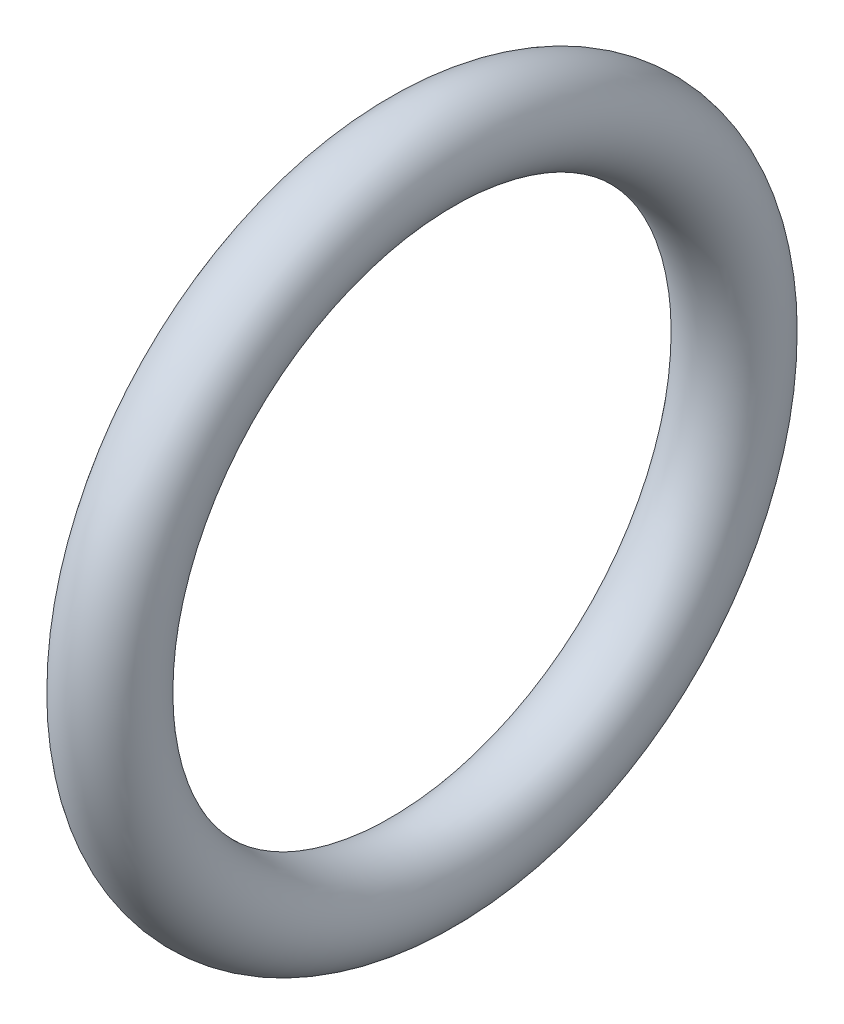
ISO-10303-21;
HEADER;
FILE_DESCRIPTION(('STEP AP214'),'2;1');
FILE_NAME('part.step','',(''),(''),'','','');
FILE_SCHEMA(('AUTOMOTIVE_DESIGN { 1 0 10303 214 1 1 1 1 }'));
ENDSEC;
DATA;
#1=APPLICATION_CONTEXT('core data for automotive mechanical design processes');
#2=APPLICATION_PROTOCOL_DEFINITION('international standard','automotive_design',2000,#1);
#3=PRODUCT_CONTEXT('',#1,'mechanical');
#4=PRODUCT('Part','Part','',(#3));
#5=PRODUCT_RELATED_PRODUCT_CATEGORY('part','',(#4));
#6=PRODUCT_DEFINITION_FORMATION('','',#4);
#7=PRODUCT_DEFINITION_CONTEXT('part definition',#1,'design');
#8=PRODUCT_DEFINITION('design','',#6,#7);
#9=PRODUCT_DEFINITION_SHAPE('','',#8);
#10=(LENGTH_UNIT() NAMED_UNIT(*) SI_UNIT(.MILLI.,.METRE.));
#11=(NAMED_UNIT(*) PLANE_ANGLE_UNIT() SI_UNIT($,.RADIAN.));
#12=(NAMED_UNIT(*) SI_UNIT($,.STERADIAN.) SOLID_ANGLE_UNIT());
#13=UNCERTAINTY_MEASURE_WITH_UNIT(LENGTH_MEASURE(1.E-05),#10,'distance_accuracy_value','');
#14=(GEOMETRIC_REPRESENTATION_CONTEXT(3) GLOBAL_UNCERTAINTY_ASSIGNED_CONTEXT((#13)) GLOBAL_UNIT_ASSIGNED_CONTEXT((#10,
#11,#12)) REPRESENTATION_CONTEXT('',''));
#15=CARTESIAN_POINT('',(0.,0.,0.));
#16=DIRECTION('',(0.,0.,1.));
#17=DIRECTION('',(1.,0.,0.));
#18=AXIS2_PLACEMENT_3D('',#15,#16,#17);
#19=CARTESIAN_POINT('',(-1.5,0.,0.));
#20=DIRECTION('',(1.,0.,0.));
#21=DIRECTION('',(0.,0.,-1.));
#22=AXIS2_PLACEMENT_3D('',#19,#20,#21);
#23=TOROIDAL_SURFACE('',#22,10.5,1.5);
#24=CARTESIAN_POINT('',(-1.5,0.,-12.));
#25=VERTEX_POINT('',#24);
#26=VERTEX_LOOP('',#25);
#27=FACE_BOUND('',#26,.T.);
#28=ADVANCED_FACE('F20',(#27),#23,.T.);
#29=CLOSED_SHELL('',(#28));
#30=MANIFOLD_SOLID_BREP('B2',#29);
#31=ADVANCED_BREP_SHAPE_REPRESENTATION('',(#18,#30),#14);
#32=SHAPE_DEFINITION_REPRESENTATION(#9,#31);
ENDSEC;
END-ISO-10303-21;
